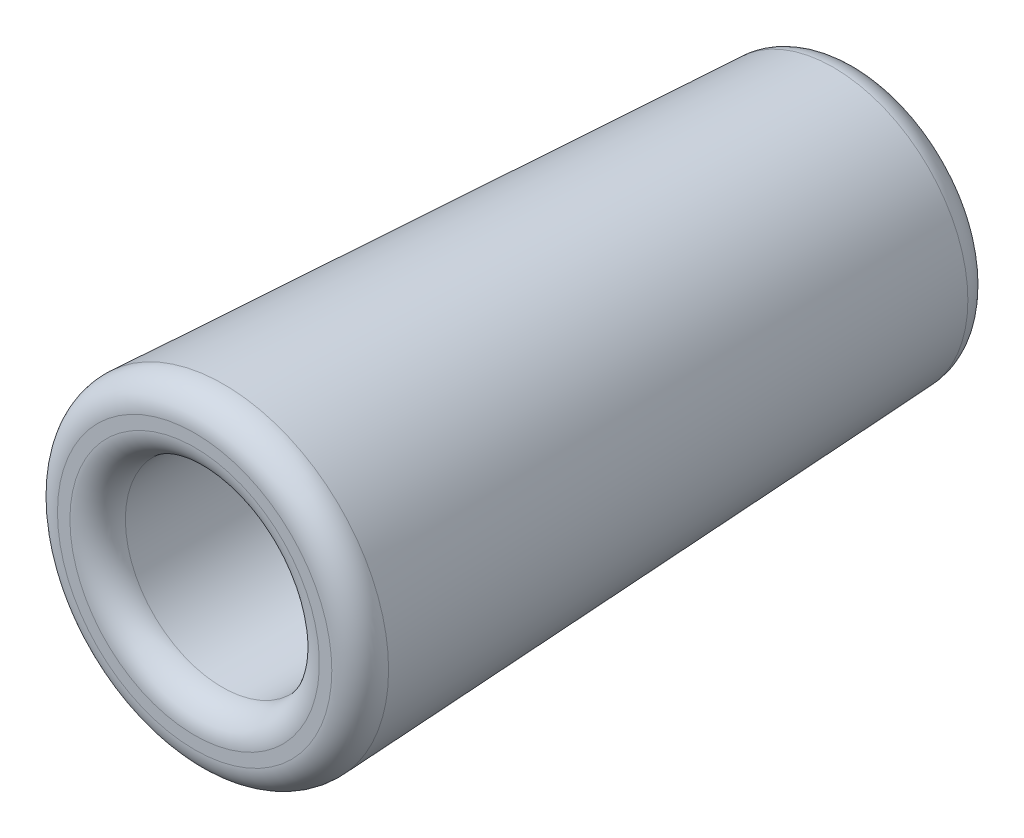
from build123d import *

# Parameters (mm, degrees)
FILLET_1_R = 0.5


with BuildPart() as part:
    # Sketch 1 → Revolve 1 (revolve)
    with BuildSketch(Plane(origin=(0, 0, 0), x_dir=(0, 0, -1), z_dir=(1, 0, 0)), mode=Mode.PRIVATE) as revolve_1_sk:
        Polygon((6, 0), (12, 0), (12, 2.4), (0, 3), (0, 1.75), (6, 1.75), align=None)
    revolve(revolve_1_sk.sketch.rotate(Axis((0, 0, -6), (0, 0, -1)), 90), axis=Axis((0, 0, -6), (0, 0, -1)))

    # Fillet 1
    fillet_1_edges = [part.edges().sort_by_distance(p)[0] for p in [
        (-1.75, 0, -6),
        (-1.75, 0, 0),
        (-3, 0, 0),
        (-2.4, 0, -12),
    ]]
    fillet(fillet_1_edges, radius=FILLET_1_R)


solid = part.part
